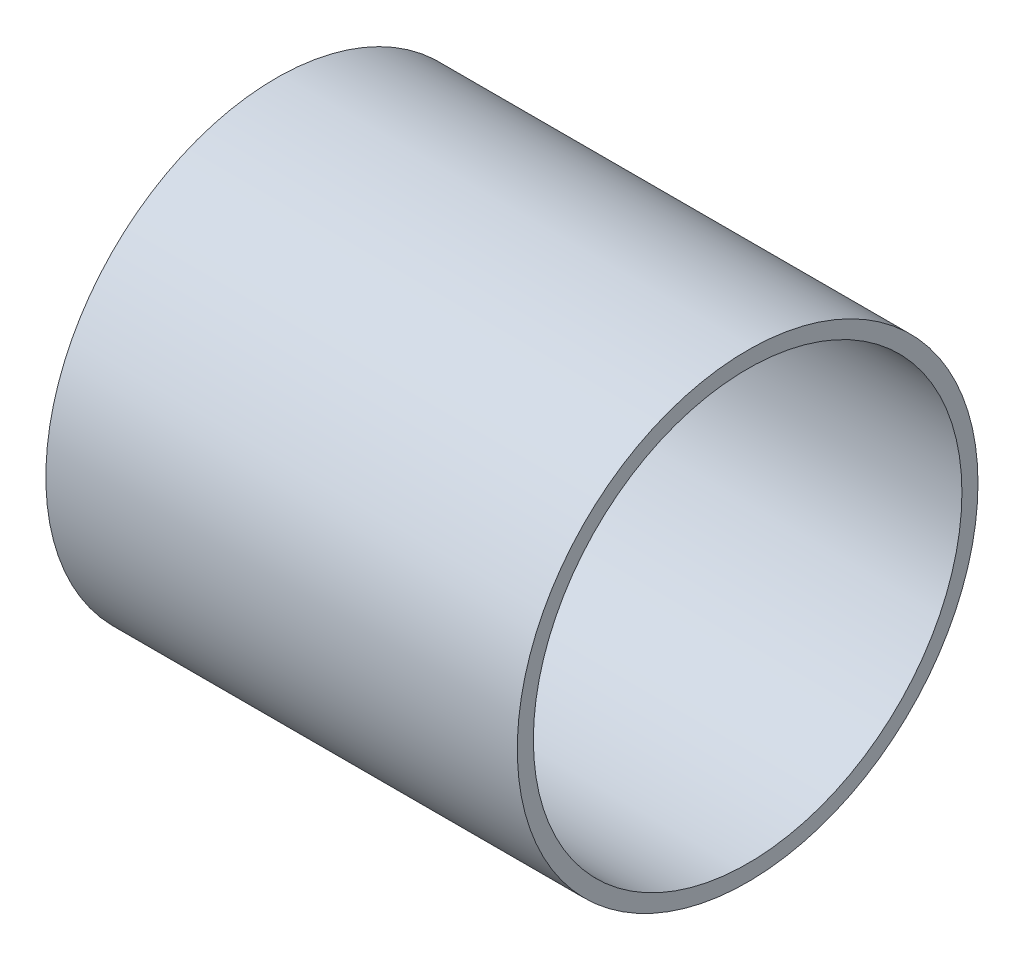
from build123d import *

# Parameters (mm, degrees)
SKETCH1_R      = 136.525
SKETCH1_R_2    = 127
EXTRUDE1_DEPTH = 279.4


with BuildPart() as part:
    # Sketch1 → Extrude1 (new body)
    with BuildSketch(Plane(origin=(0, 0, 0), x_dir=(0, 0, -1), z_dir=(1, 0, 0))):
        Circle(SKETCH1_R)
        Circle(SKETCH1_R_2, mode=Mode.SUBTRACT)
    extrude(amount=EXTRUDE1_DEPTH)


solid = part.part
